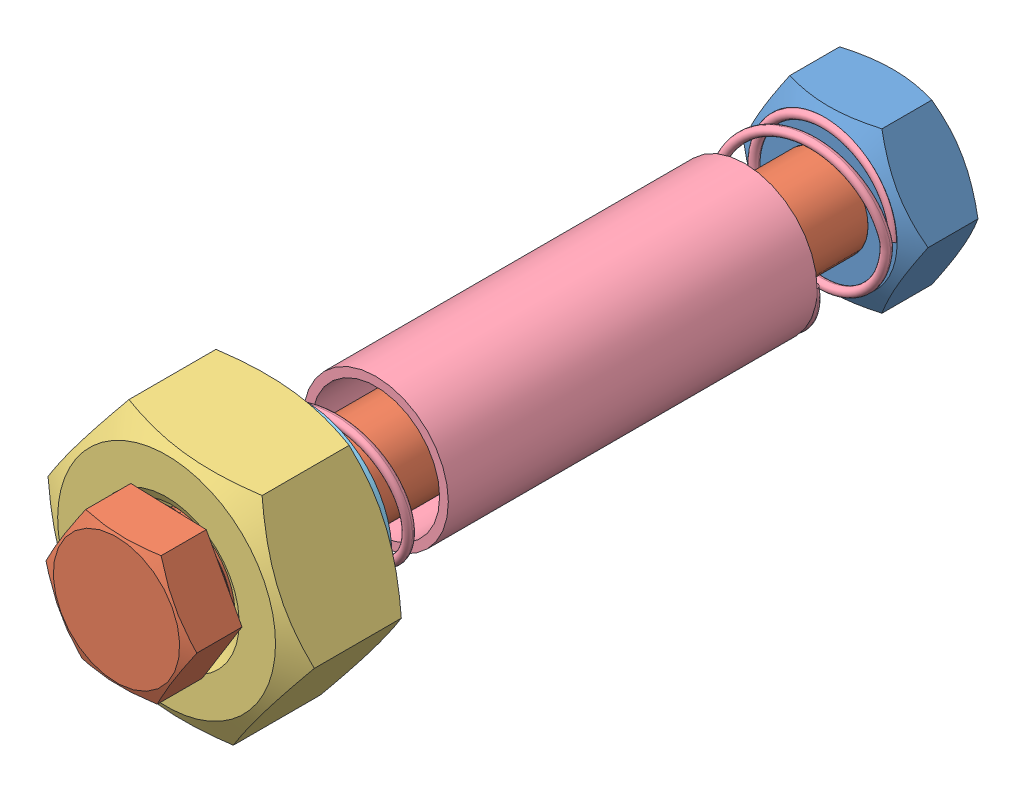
SolidWorks assembly ASM_Fissaggio_barra_emergenza.SLDASM, configuration Default (file format 14000). Lengths in mm.
Overall size (40.62 36.32 108.14).
5 component instances, 5 part files, 12 mates.
Components (placement in the parent):
- dado_din_6915_m12-3: dado_din_6915_m12.SLDPRT [Default] at origin size (25.4 22 10.55)
- vite_iso_4018-m12x100-4_8-1: vite_iso_4018-m12x100-4_8.SLDPRT [Default] at (0 0 100) x (0.473673 -0.880701 0) z (0 0 1) size (20.78 18 107.87)
- dado_din_6915_m20-1: dado_din_6915_m20.SLDPRT [Default] at (0 0 84.6) x (0.992336 -0.123569 0) z (0 0 1) size (36.95 32 17.32)
- schweizer_rdf-1818_a8vghmndfz5djlephdb523uf2-1: schweizer_rdf-1818_a8vghmndfz5djlephdb523uf2.SLDPRT [Default] at (0 0 10) size (20.06 20.06 74.07)
- din_6902-a_m12-200hv-1: din_6902-a_m12-200hv.SLDPRT [Default] at (0 0 81.6) x (-1 0 0) z (0 1 0) size (24 3 24)
Mates (geometry in assembly coordinates):
- Coincidente1: coincident aligned: plane of CE1680-3 through (0 0 0) normal (0 0 1)
- Coincidente2: coincident aligned: plane of CE1680-3 through (0 0 0) normal (0 1 0)
- Coincidente3: coincident aligned: plane of CE1680-3 through (0 0 0) normal (1 0 0)
- Concentrico4: concentric anti-aligned: cylinder of vite_iso_4018-m12x100-4_8-1 through (0 0 49.5986) axis (0 0 1) radius 6; cylinder of dado_din_6915_m20-1 through (0 0 92.6) axis (0 0 -1) radius 8.6469
- Concentrico5: concentric anti-aligned: cylinder of dado_din_6915_m12-3 through (0 0 5) axis (0 0 -1) radius 5.0528; cylinder of vite_iso_4018-m12x100-4_8-1 through (0 0 49.5986) axis (0 0 1) radius 6
- Coincidente6: coincident aligned: plane of dado_din_6915_m12-3 through (0 0 0) normal (0 0 -1); plane of vite_iso_4018-m12x100-4_8-1 through (2.225 1.1967 0) normal (0 0 -1)
- DistanzaLimite1: limit distance = 28.2594 mm anti-aligned: plane of vite_iso_4018-m12x100-4_8-1 through (6.5326 3.5135 100) normal (0 0 -1); plane of dado_din_6915_m20-1 through (0 0 100.6) normal (0 0 1)
- Coincidente7: coincident anti-aligned: plane of vite_iso_4018-m12x100-4_8-1 through (8.4668 4.5537 100.6) normal (0 0 -1); plane of dado_din_6915_m20-1 through (0 0 100.6) normal (0 0 1)
- Concentrico6: concentric aligned: cylinder of vite_iso_4018-m12x100-4_8-1 through (0 0 49.5986) axis (0 0 1) radius 6; cylinder of schweizer_rdf-1818_a8vghmndfz5djlephdb523uf2-1 through (0 0 89.5) axis (0 0 1) radius 8.8
- Coincidente8: coincident anti-aligned: plane of dado_din_6915_m12-3 through (0 0 10) normal (0 0 1); plane of schweizer_rdf-1818_a8vghmndfz5djlephdb523uf2-1 through (0 0 10) normal (0 0 -1)
- Concentrico7: concentric anti-aligned: cylinder of vite_iso_4018-m12x100-4_8-1 through (0 0 49.5986) axis (0 0 1) radius 6; cylinder of din_6902-a_m12-200hv-1 through (0 0 83.1) axis (0 0 -1) radius 6
- Coincidente9: coincident anti-aligned: plane of dado_din_6915_m20-1 through (0 0 84.6) normal (0 0 -1); plane of din_6902-a_m12-200hv-1 through (-9 0 84.6) normal (0 0 1)
